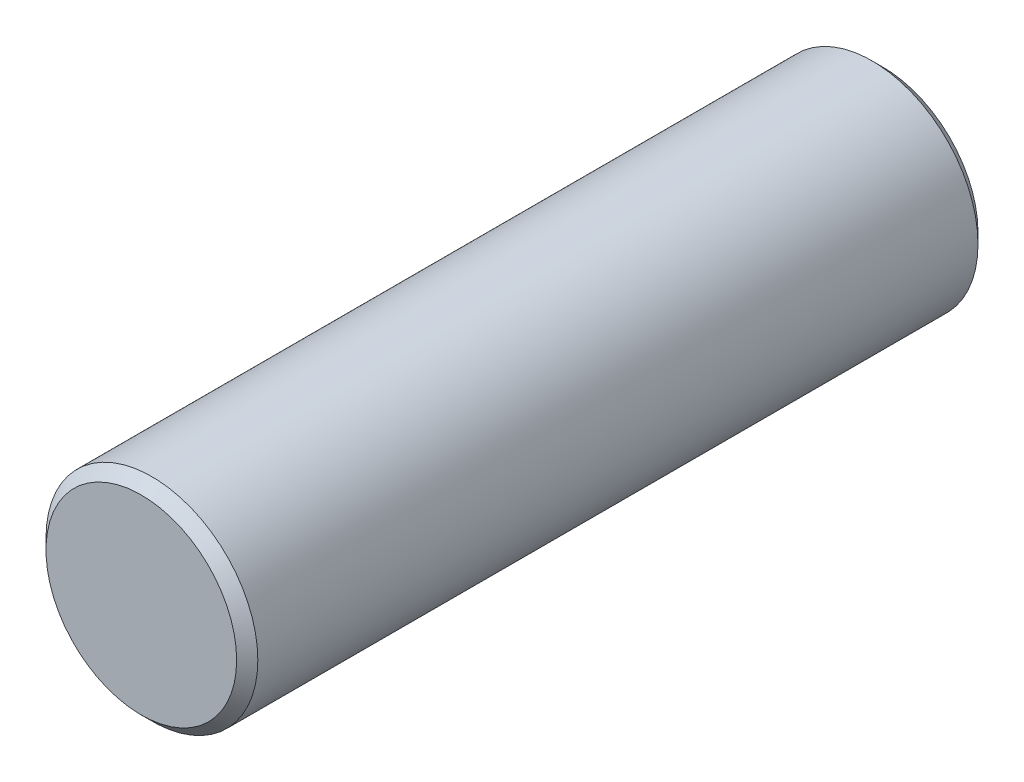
ISO-10303-21;
HEADER;
FILE_DESCRIPTION(('STEP AP214'),'2;1');
FILE_NAME('part.step','',(''),(''),'','','');
FILE_SCHEMA(('AUTOMOTIVE_DESIGN { 1 0 10303 214 1 1 1 1 }'));
ENDSEC;
DATA;
#1=APPLICATION_CONTEXT('core data for automotive mechanical design processes');
#2=APPLICATION_PROTOCOL_DEFINITION('international standard','automotive_design',2000,#1);
#3=PRODUCT_CONTEXT('',#1,'mechanical');
#4=PRODUCT('Part','Part','',(#3));
#5=PRODUCT_RELATED_PRODUCT_CATEGORY('part','',(#4));
#6=PRODUCT_DEFINITION_FORMATION('','',#4);
#7=PRODUCT_DEFINITION_CONTEXT('part definition',#1,'design');
#8=PRODUCT_DEFINITION('design','',#6,#7);
#9=PRODUCT_DEFINITION_SHAPE('','',#8);
#10=(LENGTH_UNIT() NAMED_UNIT(*) SI_UNIT(.MILLI.,.METRE.));
#11=(NAMED_UNIT(*) PLANE_ANGLE_UNIT() SI_UNIT($,.RADIAN.));
#12=(NAMED_UNIT(*) SI_UNIT($,.STERADIAN.) SOLID_ANGLE_UNIT());
#13=UNCERTAINTY_MEASURE_WITH_UNIT(LENGTH_MEASURE(1.E-05),#10,'distance_accuracy_value','');
#14=(GEOMETRIC_REPRESENTATION_CONTEXT(3) GLOBAL_UNCERTAINTY_ASSIGNED_CONTEXT((#13)) GLOBAL_UNIT_ASSIGNED_CONTEXT((#10,
#11,#12)) REPRESENTATION_CONTEXT('',''));
#15=CARTESIAN_POINT('',(0.,0.,0.));
#16=DIRECTION('',(0.,0.,1.));
#17=DIRECTION('',(1.,0.,0.));
#18=AXIS2_PLACEMENT_3D('',#15,#16,#17);
#19=CARTESIAN_POINT('',(0.,0.,14.));
#20=DIRECTION('',(0.,0.,-1.));
#21=DIRECTION('',(-1.,0.,0.));
#22=AXIS2_PLACEMENT_3D('',#19,#20,#21);
#23=CYLINDRICAL_SURFACE('',#22,2.);
#24=CARTESIAN_POINT('',(0.,0.,0.199999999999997));
#25=DIRECTION('',(0.,0.,1.));
#26=DIRECTION('',(1.,0.,0.));
#27=AXIS2_PLACEMENT_3D('',#24,#25,#26);
#28=CIRCLE('',#27,2.);
#29=CARTESIAN_POINT('',(2.,0.,0.199999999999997));
#30=VERTEX_POINT('',#29);
#31=EDGE_CURVE('E42',#30,#30,#28,.T.);
#32=ORIENTED_EDGE('',*,*,#31,.T.);
#33=EDGE_LOOP('',(#32));
#34=FACE_BOUND('',#33,.T.);
#35=CARTESIAN_POINT('',(0.,0.,13.8));
#36=DIRECTION('',(0.,0.,1.));
#37=DIRECTION('',(1.,0.,0.));
#38=AXIS2_PLACEMENT_3D('',#35,#36,#37);
#39=CIRCLE('',#38,2.);
#40=CARTESIAN_POINT('',(2.,0.,13.8));
#41=VERTEX_POINT('',#40);
#42=EDGE_CURVE('E46',#41,#41,#39,.F.);
#43=ORIENTED_EDGE('',*,*,#42,.T.);
#44=EDGE_LOOP('',(#43));
#45=FACE_BOUND('',#44,.T.);
#46=ADVANCED_FACE('F31',(#34,#45),#23,.T.);
#47=CARTESIAN_POINT('',(0.,0.,14.));
#48=DIRECTION('',(0.,0.,1.));
#49=DIRECTION('',(1.,0.,0.));
#50=AXIS2_PLACEMENT_3D('',#47,#48,#49);
#51=PLANE('',#50);
#52=CARTESIAN_POINT('',(0.,0.,14.));
#53=DIRECTION('',(0.,0.,1.));
#54=DIRECTION('',(1.,0.,0.));
#55=AXIS2_PLACEMENT_3D('',#52,#53,#54);
#56=CIRCLE('',#55,1.8);
#57=CARTESIAN_POINT('',(1.8,0.,14.));
#58=VERTEX_POINT('',#57);
#59=EDGE_CURVE('E10',#58,#58,#56,.T.);
#60=ORIENTED_EDGE('',*,*,#59,.T.);
#61=EDGE_LOOP('',(#60));
#62=FACE_BOUND('',#61,.T.);
#63=ADVANCED_FACE('F62',(#62),#51,.T.);
#64=CARTESIAN_POINT('',(0.,0.,0.));
#65=DIRECTION('',(0.,0.,1.));
#66=DIRECTION('',(1.,0.,0.));
#67=AXIS2_PLACEMENT_3D('',#64,#65,#66);
#68=PLANE('',#67);
#69=CARTESIAN_POINT('',(0.,0.,0.));
#70=DIRECTION('',(0.,0.,1.));
#71=DIRECTION('',(1.,0.,0.));
#72=AXIS2_PLACEMENT_3D('',#69,#70,#71);
#73=CIRCLE('',#72,1.8);
#74=CARTESIAN_POINT('',(1.8,0.,0.));
#75=VERTEX_POINT('',#74);
#76=EDGE_CURVE('E38',#75,#75,#73,.F.);
#77=ORIENTED_EDGE('',*,*,#76,.T.);
#78=EDGE_LOOP('',(#77));
#79=FACE_BOUND('',#78,.T.);
#80=ADVANCED_FACE('F59',(#79),#68,.F.);
#81=CARTESIAN_POINT('',(0.,0.,0.199999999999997));
#82=DIRECTION('',(0.,0.,1.));
#83=DIRECTION('',(1.,0.,0.));
#84=AXIS2_PLACEMENT_3D('',#81,#82,#83);
#85=CONICAL_SURFACE('',#84,2.,0.785398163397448);
#86=ORIENTED_EDGE('',*,*,#76,.F.);
#87=EDGE_LOOP('',(#86));
#88=FACE_BOUND('',#87,.T.);
#89=ORIENTED_EDGE('',*,*,#31,.F.);
#90=EDGE_LOOP('',(#89));
#91=FACE_BOUND('',#90,.T.);
#92=ADVANCED_FACE('F55',(#88,#91),#85,.T.);
#93=CARTESIAN_POINT('',(0.,0.,14.));
#94=DIRECTION('',(0.,0.,-1.));
#95=DIRECTION('',(-1.,0.,0.));
#96=AXIS2_PLACEMENT_3D('',#93,#94,#95);
#97=CONICAL_SURFACE('',#96,1.8,0.785398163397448);
#98=ORIENTED_EDGE('',*,*,#42,.F.);
#99=EDGE_LOOP('',(#98));
#100=FACE_BOUND('',#99,.T.);
#101=ORIENTED_EDGE('',*,*,#59,.F.);
#102=EDGE_LOOP('',(#101));
#103=FACE_BOUND('',#102,.T.);
#104=ADVANCED_FACE('F33',(#100,#103),#97,.T.);
#105=CLOSED_SHELL('',(#46,#63,#80,#92,#104));
#106=MANIFOLD_SOLID_BREP('B2',#105);
#107=ADVANCED_BREP_SHAPE_REPRESENTATION('',(#18,#106),#14);
#108=SHAPE_DEFINITION_REPRESENTATION(#9,#107);
ENDSEC;
END-ISO-10303-21;
